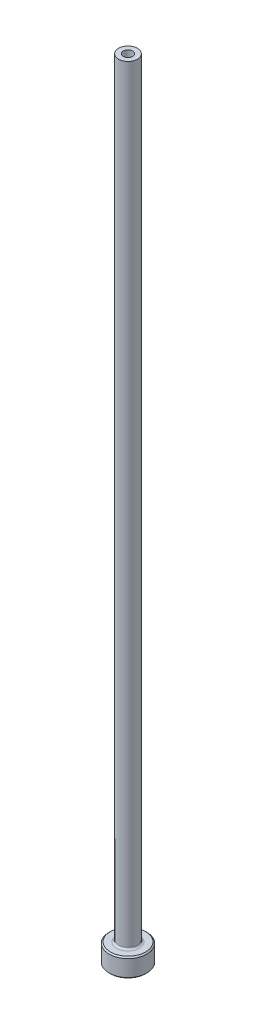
ISO-10303-21;
HEADER;
FILE_DESCRIPTION(('STEP AP214'),'2;1');
FILE_NAME('part.step','',(''),(''),'','','');
FILE_SCHEMA(('AUTOMOTIVE_DESIGN { 1 0 10303 214 1 1 1 1 }'));
ENDSEC;
DATA;
#1=APPLICATION_CONTEXT('core data for automotive mechanical design processes');
#2=APPLICATION_PROTOCOL_DEFINITION('international standard','automotive_design',2000,#1);
#3=PRODUCT_CONTEXT('',#1,'mechanical');
#4=PRODUCT('Part','Part','',(#3));
#5=PRODUCT_RELATED_PRODUCT_CATEGORY('part','',(#4));
#6=PRODUCT_DEFINITION_FORMATION('','',#4);
#7=PRODUCT_DEFINITION_CONTEXT('part definition',#1,'design');
#8=PRODUCT_DEFINITION('design','',#6,#7);
#9=PRODUCT_DEFINITION_SHAPE('','',#8);
#10=(LENGTH_UNIT() NAMED_UNIT(*) SI_UNIT(.MILLI.,.METRE.));
#11=(NAMED_UNIT(*) PLANE_ANGLE_UNIT() SI_UNIT($,.RADIAN.));
#12=(NAMED_UNIT(*) SI_UNIT($,.STERADIAN.) SOLID_ANGLE_UNIT());
#13=UNCERTAINTY_MEASURE_WITH_UNIT(LENGTH_MEASURE(1.E-05),#10,'distance_accuracy_value','');
#14=(GEOMETRIC_REPRESENTATION_CONTEXT(3) GLOBAL_UNCERTAINTY_ASSIGNED_CONTEXT((#13)) GLOBAL_UNIT_ASSIGNED_CONTEXT((#10,
#11,#12)) REPRESENTATION_CONTEXT('',''));
#15=CARTESIAN_POINT('',(0.,0.,0.));
#16=DIRECTION('',(0.,0.,1.));
#17=DIRECTION('',(1.,0.,0.));
#18=AXIS2_PLACEMENT_3D('',#15,#16,#17);
#19=CARTESIAN_POINT('',(0.,92.1876809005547,0.));
#20=DIRECTION('',(0.,1.,0.));
#21=DIRECTION('',(0.,0.,1.));
#22=AXIS2_PLACEMENT_3D('',#19,#20,#21);
#23=CYLINDRICAL_SURFACE('',#22,0.749999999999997);
#24=CARTESIAN_POINT('',(0.,125.,0.));
#25=DIRECTION('',(0.,1.,0.));
#26=DIRECTION('',(0.,0.,1.));
#27=AXIS2_PLACEMENT_3D('',#24,#25,#26);
#28=CIRCLE('',#27,0.749999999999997);
#29=CARTESIAN_POINT('',(0.,125.,0.749999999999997));
#30=VERTEX_POINT('',#29);
#31=EDGE_CURVE('E62',#30,#30,#28,.T.);
#32=ORIENTED_EDGE('',*,*,#31,.T.);
#33=EDGE_LOOP('',(#32));
#34=FACE_BOUND('',#33,.T.);
#35=CARTESIAN_POINT('',(0.,90.,0.));
#36=DIRECTION('',(0.,1.,0.));
#37=DIRECTION('',(0.,0.,1.));
#38=AXIS2_PLACEMENT_3D('',#35,#36,#37);
#39=CIRCLE('',#38,0.749999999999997);
#40=CARTESIAN_POINT('',(0.,90.,0.749999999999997));
#41=VERTEX_POINT('',#40);
#42=EDGE_CURVE('E71',#41,#41,#39,.T.);
#43=ORIENTED_EDGE('',*,*,#42,.F.);
#44=EDGE_LOOP('',(#43));
#45=FACE_BOUND('',#44,.T.);
#46=ADVANCED_FACE('F30',(#34,#45),#23,.F.);
#47=CARTESIAN_POINT('',(-0.749999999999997,125.,0.));
#48=DIRECTION('',(0.,1.,0.));
#49=DIRECTION('',(0.,0.,1.));
#50=AXIS2_PLACEMENT_3D('',#47,#48,#49);
#51=PLANE('',#50);
#52=CARTESIAN_POINT('',(0.,125.,0.));
#53=DIRECTION('',(0.,1.,0.));
#54=DIRECTION('',(0.,0.,1.));
#55=AXIS2_PLACEMENT_3D('',#52,#53,#54);
#56=CIRCLE('',#55,1.5);
#57=CARTESIAN_POINT('',(0.,125.,1.5));
#58=VERTEX_POINT('',#57);
#59=EDGE_CURVE('E65',#58,#58,#56,.T.);
#60=ORIENTED_EDGE('',*,*,#59,.T.);
#61=EDGE_LOOP('',(#60));
#62=FACE_BOUND('',#61,.T.);
#63=ORIENTED_EDGE('',*,*,#31,.F.);
#64=EDGE_LOOP('',(#63));
#65=FACE_BOUND('',#64,.T.);
#66=ADVANCED_FACE('F79',(#62,#65),#51,.T.);
#67=CARTESIAN_POINT('',(0.,92.1876809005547,0.));
#68=DIRECTION('',(0.,1.,0.));
#69=DIRECTION('',(0.,0.,1.));
#70=AXIS2_PLACEMENT_3D('',#67,#68,#69);
#71=CYLINDRICAL_SURFACE('',#70,1.5);
#72=CARTESIAN_POINT('',(0.,3.3,0.));
#73=DIRECTION('',(0.,1.,0.));
#74=DIRECTION('',(0.,0.,1.));
#75=AXIS2_PLACEMENT_3D('',#72,#73,#74);
#76=CIRCLE('',#75,1.5);
#77=CARTESIAN_POINT('',(0.,3.3,1.5));
#78=VERTEX_POINT('',#77);
#79=EDGE_CURVE('E59',#78,#78,#76,.T.);
#80=ORIENTED_EDGE('',*,*,#79,.T.);
#81=EDGE_LOOP('',(#80));
#82=FACE_BOUND('',#81,.T.);
#83=ORIENTED_EDGE('',*,*,#59,.F.);
#84=EDGE_LOOP('',(#83));
#85=FACE_BOUND('',#84,.T.);
#86=ADVANCED_FACE('F85',(#82,#85),#71,.T.);
#87=CARTESIAN_POINT('',(-1.49999999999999,3.,0.));
#88=DIRECTION('',(0.,1.,0.));
#89=DIRECTION('',(0.,0.,1.));
#90=AXIS2_PLACEMENT_3D('',#87,#88,#89);
#91=PLANE('',#90);
#92=CARTESIAN_POINT('',(0.,3.,0.));
#93=DIRECTION('',(0.,1.,0.));
#94=DIRECTION('',(0.,0.,1.));
#95=AXIS2_PLACEMENT_3D('',#92,#93,#94);
#96=CIRCLE('',#95,2.80000000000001);
#97=CARTESIAN_POINT('',(0.,3.,2.80000000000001));
#98=VERTEX_POINT('',#97);
#99=EDGE_CURVE('E53',#98,#98,#96,.T.);
#100=ORIENTED_EDGE('',*,*,#99,.T.);
#101=EDGE_LOOP('',(#100));
#102=FACE_BOUND('',#101,.T.);
#103=CARTESIAN_POINT('',(0.,3.,0.));
#104=DIRECTION('',(0.,1.,0.));
#105=DIRECTION('',(0.,0.,1.));
#106=AXIS2_PLACEMENT_3D('',#103,#104,#105);
#107=CIRCLE('',#106,1.8);
#108=CARTESIAN_POINT('',(0.,3.,1.8));
#109=VERTEX_POINT('',#108);
#110=EDGE_CURVE('E56',#109,#109,#107,.F.);
#111=ORIENTED_EDGE('',*,*,#110,.T.);
#112=EDGE_LOOP('',(#111));
#113=FACE_BOUND('',#112,.T.);
#114=ADVANCED_FACE('F111',(#102,#113),#91,.T.);
#115=CARTESIAN_POINT('',(0.,92.1876809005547,0.));
#116=DIRECTION('',(0.,1.,0.));
#117=DIRECTION('',(0.,0.,1.));
#118=AXIS2_PLACEMENT_3D('',#115,#116,#117);
#119=CYLINDRICAL_SURFACE('',#118,2.99999999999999);
#120=CARTESIAN_POINT('',(0.,2.80000000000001,0.));
#121=DIRECTION('',(0.,1.,0.));
#122=DIRECTION('',(0.,0.,1.));
#123=AXIS2_PLACEMENT_3D('',#120,#121,#122);
#124=CIRCLE('',#123,2.99999999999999);
#125=CARTESIAN_POINT('',(0.,2.80000000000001,2.99999999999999));
#126=VERTEX_POINT('',#125);
#127=EDGE_CURVE('E45',#126,#126,#124,.F.);
#128=ORIENTED_EDGE('',*,*,#127,.T.);
#129=EDGE_LOOP('',(#128));
#130=FACE_BOUND('',#129,.T.);
#131=CARTESIAN_POINT('',(0.,0.199999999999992,0.));
#132=DIRECTION('',(0.,-1.,0.));
#133=DIRECTION('',(0.,0.,-1.));
#134=AXIS2_PLACEMENT_3D('',#131,#132,#133);
#135=CIRCLE('',#134,2.99999999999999);
#136=CARTESIAN_POINT('',(0.,0.199999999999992,-2.99999999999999));
#137=VERTEX_POINT('',#136);
#138=EDGE_CURVE('E50',#137,#137,#135,.F.);
#139=ORIENTED_EDGE('',*,*,#138,.T.);
#140=EDGE_LOOP('',(#139));
#141=FACE_BOUND('',#140,.T.);
#142=ADVANCED_FACE('F108',(#130,#141),#119,.T.);
#143=CARTESIAN_POINT('',(-2.99999999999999,0.,0.));
#144=DIRECTION('',(0.,-1.,0.));
#145=DIRECTION('',(0.,0.,-1.));
#146=AXIS2_PLACEMENT_3D('',#143,#144,#145);
#147=PLANE('',#146);
#148=CARTESIAN_POINT('',(0.,0.,0.));
#149=DIRECTION('',(0.,-1.,0.));
#150=DIRECTION('',(0.,0.,-1.));
#151=AXIS2_PLACEMENT_3D('',#148,#149,#150);
#152=CIRCLE('',#151,1.49999999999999);
#153=CARTESIAN_POINT('',(0.,0.,-1.49999999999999));
#154=VERTEX_POINT('',#153);
#155=EDGE_CURVE('E37',#154,#154,#152,.F.);
#156=ORIENTED_EDGE('',*,*,#155,.T.);
#157=EDGE_LOOP('',(#156));
#158=FACE_BOUND('',#157,.T.);
#159=CARTESIAN_POINT('',(0.,0.,0.));
#160=DIRECTION('',(0.,-1.,0.));
#161=DIRECTION('',(0.,0.,-1.));
#162=AXIS2_PLACEMENT_3D('',#159,#160,#161);
#163=CIRCLE('',#162,2.79999999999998);
#164=CARTESIAN_POINT('',(0.,0.,-2.79999999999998));
#165=VERTEX_POINT('',#164);
#166=EDGE_CURVE('E41',#165,#165,#163,.T.);
#167=ORIENTED_EDGE('',*,*,#166,.T.);
#168=EDGE_LOOP('',(#167));
#169=FACE_BOUND('',#168,.T.);
#170=ADVANCED_FACE('F110',(#158,#169),#147,.T.);
#171=CARTESIAN_POINT('',(0.,92.1876809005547,0.));
#172=DIRECTION('',(0.,1.,0.));
#173=DIRECTION('',(0.,0.,1.));
#174=AXIS2_PLACEMENT_3D('',#171,#172,#173);
#175=CYLINDRICAL_SURFACE('',#174,0.999999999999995);
#176=CARTESIAN_POINT('',(0.,0.499999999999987,0.));
#177=DIRECTION('',(0.,-1.,0.));
#178=DIRECTION('',(0.,0.,-1.));
#179=AXIS2_PLACEMENT_3D('',#176,#177,#178);
#180=CIRCLE('',#179,0.999999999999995);
#181=CARTESIAN_POINT('',(0.,0.499999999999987,-0.999999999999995));
#182=VERTEX_POINT('',#181);
#183=EDGE_CURVE('E10',#182,#182,#180,.T.);
#184=ORIENTED_EDGE('',*,*,#183,.T.);
#185=EDGE_LOOP('',(#184));
#186=FACE_BOUND('',#185,.T.);
#187=CARTESIAN_POINT('',(0.,78.,0.));
#188=DIRECTION('',(0.,1.,0.));
#189=DIRECTION('',(0.,0.,1.));
#190=AXIS2_PLACEMENT_3D('',#187,#188,#189);
#191=CIRCLE('',#190,1.);
#192=CARTESIAN_POINT('',(0.,78.,1.));
#193=VERTEX_POINT('',#192);
#194=EDGE_CURVE('E68',#193,#193,#191,.T.);
#195=ORIENTED_EDGE('',*,*,#194,.T.);
#196=EDGE_LOOP('',(#195));
#197=FACE_BOUND('',#196,.T.);
#198=ADVANCED_FACE('F118',(#186,#197),#175,.F.);
#199=CARTESIAN_POINT('',(0.,78.,0.));
#200=DIRECTION('',(0.,-1.,0.));
#201=DIRECTION('',(0.,0.,-1.));
#202=AXIS2_PLACEMENT_3D('',#199,#200,#201);
#203=CONICAL_SURFACE('',#202,1.,0.0208303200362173);
#204=ORIENTED_EDGE('',*,*,#42,.T.);
#205=EDGE_LOOP('',(#204));
#206=FACE_BOUND('',#205,.T.);
#207=ORIENTED_EDGE('',*,*,#194,.F.);
#208=EDGE_LOOP('',(#207));
#209=FACE_BOUND('',#208,.T.);
#210=ADVANCED_FACE('F75',(#206,#209),#203,.F.);
#211=CARTESIAN_POINT('',(0.,3.3,0.));
#212=DIRECTION('',(0.,1.,0.));
#213=DIRECTION('',(0.,0.,1.));
#214=AXIS2_PLACEMENT_3D('',#211,#212,#213);
#215=TOROIDAL_SURFACE('',#214,1.8,0.3);
#216=ORIENTED_EDGE('',*,*,#110,.F.);
#217=EDGE_LOOP('',(#216));
#218=FACE_BOUND('',#217,.T.);
#219=ORIENTED_EDGE('',*,*,#79,.F.);
#220=EDGE_LOOP('',(#219));
#221=FACE_BOUND('',#220,.T.);
#222=ADVANCED_FACE('F90',(#218,#221),#215,.F.);
#223=CARTESIAN_POINT('',(0.,3.,0.));
#224=DIRECTION('',(0.,-1.,0.));
#225=DIRECTION('',(0.,0.,-1.));
#226=AXIS2_PLACEMENT_3D('',#223,#224,#225);
#227=CONICAL_SURFACE('',#226,2.80000000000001,0.785398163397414);
#228=ORIENTED_EDGE('',*,*,#127,.F.);
#229=EDGE_LOOP('',(#228));
#230=FACE_BOUND('',#229,.T.);
#231=ORIENTED_EDGE('',*,*,#99,.F.);
#232=EDGE_LOOP('',(#231));
#233=FACE_BOUND('',#232,.T.);
#234=ADVANCED_FACE('F93',(#230,#233),#227,.T.);
#235=CARTESIAN_POINT('',(0.,0.199999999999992,0.));
#236=DIRECTION('',(0.,1.,0.));
#237=DIRECTION('',(0.,0.,1.));
#238=AXIS2_PLACEMENT_3D('',#235,#236,#237);
#239=CONICAL_SURFACE('',#238,2.99999999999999,0.785398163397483);
#240=ORIENTED_EDGE('',*,*,#166,.F.);
#241=EDGE_LOOP('',(#240));
#242=FACE_BOUND('',#241,.T.);
#243=ORIENTED_EDGE('',*,*,#138,.F.);
#244=EDGE_LOOP('',(#243));
#245=FACE_BOUND('',#244,.T.);
#246=ADVANCED_FACE('F96',(#242,#245),#239,.T.);
#247=CARTESIAN_POINT('',(0.,0.,0.));
#248=DIRECTION('',(0.,-1.,0.));
#249=DIRECTION('',(0.,0.,-1.));
#250=AXIS2_PLACEMENT_3D('',#247,#248,#249);
#251=CONICAL_SURFACE('',#250,1.49999999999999,0.785398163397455);
#252=ORIENTED_EDGE('',*,*,#183,.F.);
#253=EDGE_LOOP('',(#252));
#254=FACE_BOUND('',#253,.T.);
#255=ORIENTED_EDGE('',*,*,#155,.F.);
#256=EDGE_LOOP('',(#255));
#257=FACE_BOUND('',#256,.T.);
#258=ADVANCED_FACE('F32',(#254,#257),#251,.F.);
#259=CLOSED_SHELL('',(#46,#66,#86,#114,#142,#170,#198,#210,#222,#234,#246,#258));
#260=MANIFOLD_SOLID_BREP('B2',#259);
#261=ADVANCED_BREP_SHAPE_REPRESENTATION('',(#18,#260),#14);
#262=SHAPE_DEFINITION_REPRESENTATION(#9,#261);
ENDSEC;
END-ISO-10303-21;
